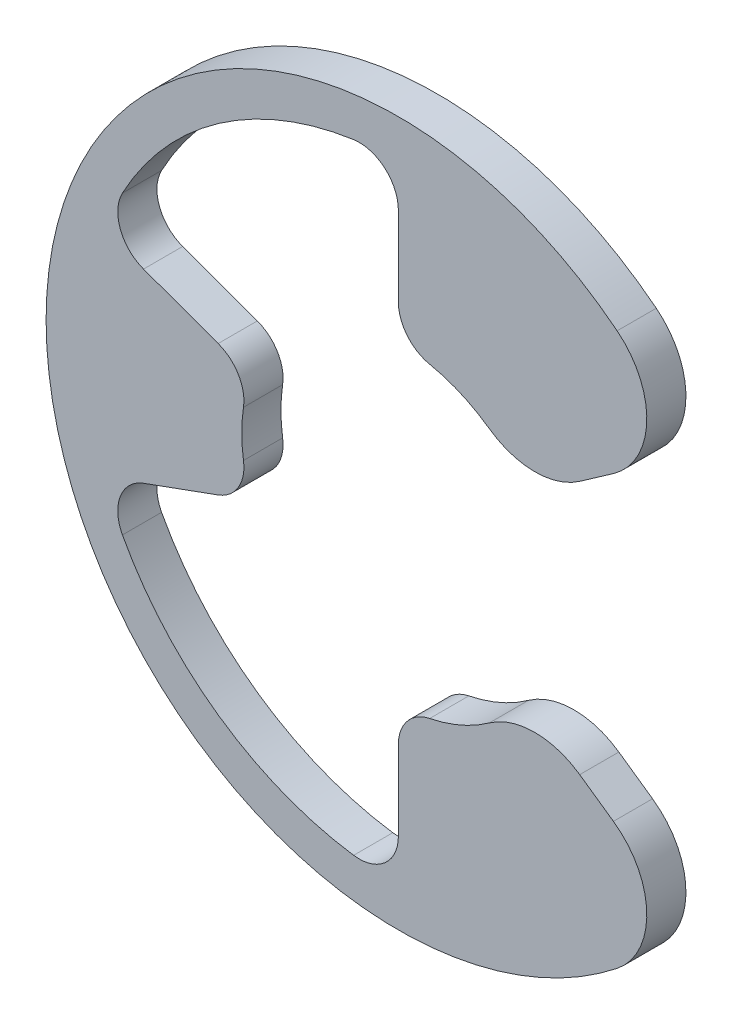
from build123d import *

# Parameters (mm, degrees)
BASE_EXTRUSION_DEPTH = 0.5


with BuildPart() as part:
    # Esquisse1 → Base-Extrusion (new body)
    with BuildSketch(Plane.XY):
        with BuildLine():
            Line((0, 3.464101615), (0, 2.449489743))
            ThreePointArc((0, 2.449489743), (0.112701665, 2.133261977), (0.4, 1.959591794))
            ThreePointArc((0.4, 1.959591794), (0.798550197, 1.833662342), (1.162223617, 1.627647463))
            ThreePointArc((1.162223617, 1.627647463), (1.738720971, 1.441481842), (2.316911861, 1.622319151))
            Line((2.316911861, 1.622319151), (2.747519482, 1.923833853))
            ThreePointArc((2.747519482, 1.923833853), (3.173503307, 2.71333317), (2.795069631, 3.526696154))
            ThreePointArc((2.795069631, 3.526696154), (-4.5, 0), (2.795069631, -3.526696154))
            ThreePointArc((2.795069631, -3.526696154), (3.173503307, -2.71333317), (2.747519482, -1.923833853))
            Line((2.747519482, -1.923833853), (2.316911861, -1.622319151))
            ThreePointArc((2.316911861, -1.622319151), (1.738720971, -1.441481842), (1.162223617, -1.627647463))
            ThreePointArc((1.162223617, -1.627647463), (0.798550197, -1.833662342), (0.4, -1.959591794))
            ThreePointArc((0.4, -1.959591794), (0.112701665, -2.133261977), (0, -2.449489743))
            Line((0, -2.449489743), (0, -3.464101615))
            ThreePointArc((0, -3.464101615), (-0.172673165, -3.842066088), (-0.571428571, -3.958973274))
            ThreePointArc((-0.571428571, -3.958973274), (-2.294305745, -3.276608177), (-3.52477789, -1.891015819))
            ThreePointArc((-3.52477789, -1.891015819), (-3.551303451, -1.476323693), (-3.255190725, -1.184792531))
            Line((-3.255190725, -1.184792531), (-2.301767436, -0.837774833))
            ThreePointArc((-2.301767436, -0.837774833), (-2.043156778, -0.623713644), (-1.978222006, -0.294342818))
            ThreePointArc((-1.978222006, -0.294342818), (-2, 0), (-1.978222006, 0.294342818))
            ThreePointArc((-1.978222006, 0.294342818), (-2.043156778, 0.623713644), (-2.301767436, 0.837774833))
            Line((-2.301767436, 0.837774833), (-3.255190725, 1.184792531))
            ThreePointArc((-3.255190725, 1.184792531), (-3.551303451, 1.476323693), (-3.52477789, 1.891015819))
            ThreePointArc((-3.52477789, 1.891015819), (-2.294305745, 3.276608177), (-0.571428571, 3.958973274))
            ThreePointArc((-0.571428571, 3.958973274), (-0.172673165, 3.842066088), (0, 3.464101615))
        make_face()
    extrude(amount=BASE_EXTRUSION_DEPTH)


solid = part.part
